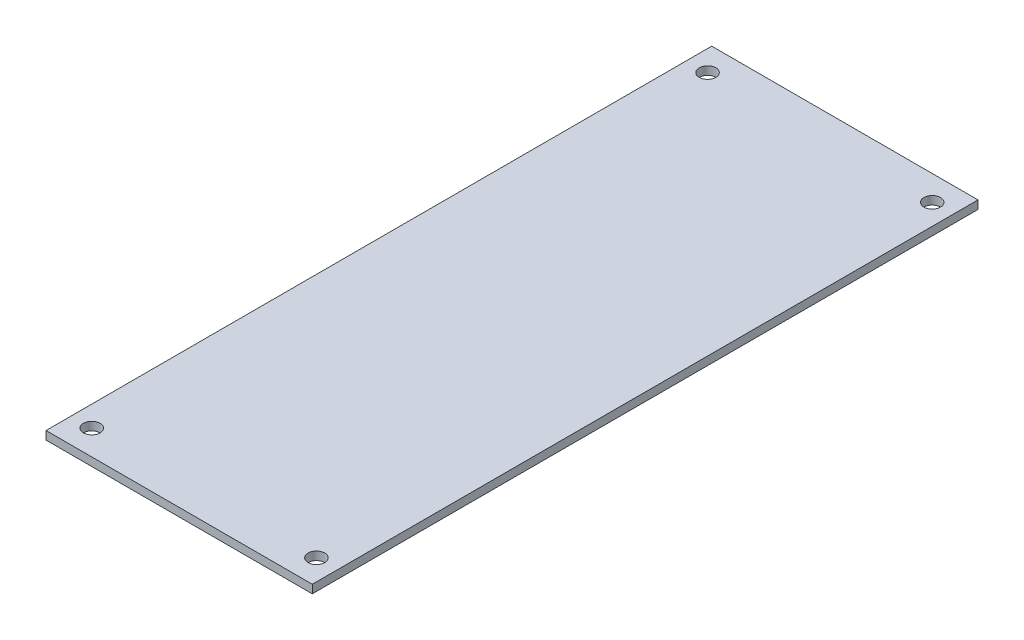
ISO-10303-21;
HEADER;
FILE_DESCRIPTION(('STEP AP214'),'2;1');
FILE_NAME('part.step','',(''),(''),'','','');
FILE_SCHEMA(('AUTOMOTIVE_DESIGN { 1 0 10303 214 1 1 1 1 }'));
ENDSEC;
DATA;
#1=APPLICATION_CONTEXT('core data for automotive mechanical design processes');
#2=APPLICATION_PROTOCOL_DEFINITION('international standard','automotive_design',2000,#1);
#3=PRODUCT_CONTEXT('',#1,'mechanical');
#4=PRODUCT('Part','Part','',(#3));
#5=PRODUCT_RELATED_PRODUCT_CATEGORY('part','',(#4));
#6=PRODUCT_DEFINITION_FORMATION('','',#4);
#7=PRODUCT_DEFINITION_CONTEXT('part definition',#1,'design');
#8=PRODUCT_DEFINITION('design','',#6,#7);
#9=PRODUCT_DEFINITION_SHAPE('','',#8);
#10=(LENGTH_UNIT() NAMED_UNIT(*) SI_UNIT(.MILLI.,.METRE.));
#11=(NAMED_UNIT(*) PLANE_ANGLE_UNIT() SI_UNIT($,.RADIAN.));
#12=(NAMED_UNIT(*) SI_UNIT($,.STERADIAN.) SOLID_ANGLE_UNIT());
#13=UNCERTAINTY_MEASURE_WITH_UNIT(LENGTH_MEASURE(1.E-05),#10,'distance_accuracy_value','');
#14=(GEOMETRIC_REPRESENTATION_CONTEXT(3) GLOBAL_UNCERTAINTY_ASSIGNED_CONTEXT((#13)) GLOBAL_UNIT_ASSIGNED_CONTEXT((#10,
#11,#12)) REPRESENTATION_CONTEXT('',''));
#15=CARTESIAN_POINT('',(0.,0.,0.));
#16=DIRECTION('',(0.,0.,1.));
#17=DIRECTION('',(1.,0.,0.));
#18=AXIS2_PLACEMENT_3D('',#15,#16,#17);
#19=CARTESIAN_POINT('',(0.,0.,0.));
#20=DIRECTION('',(0.,1.,0.));
#21=DIRECTION('',(0.,0.,1.));
#22=AXIS2_PLACEMENT_3D('',#19,#20,#21);
#23=PLANE('',#22);
#24=DIRECTION('',(1.,0.,0.));
#25=VECTOR('',#24,1.);
#26=CARTESIAN_POINT('',(2.15876699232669E-13,0.,55.5625000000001));
#27=LINE('',#26,#25);
#28=CARTESIAN_POINT('',(18.25625,0.,55.5625));
#29=VERTEX_POINT('',#28);
#30=CARTESIAN_POINT('',(25.4,0.,55.5625));
#31=VERTEX_POINT('',#30);
#32=EDGE_CURVE('E13',#29,#31,#27,.T.);
#33=ORIENTED_EDGE('',*,*,#32,.F.);
#34=DIRECTION('',(0.,0.,-1.));
#35=VECTOR('',#34,1.);
#36=CARTESIAN_POINT('',(18.25625,0.,0.));
#37=LINE('',#36,#35);
#38=CARTESIAN_POINT('',(18.25625,0.,61.9125));
#39=VERTEX_POINT('',#38);
#40=EDGE_CURVE('E61',#39,#29,#37,.T.);
#41=ORIENTED_EDGE('',*,*,#40,.F.);
#42=DIRECTION('',(-1.,0.,0.));
#43=VECTOR('',#42,1.);
#44=CARTESIAN_POINT('',(2.40548322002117E-13,0.,61.9125000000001));
#45=LINE('',#44,#43);
#46=CARTESIAN_POINT('',(25.4,0.,61.9125));
#47=VERTEX_POINT('',#46);
#48=EDGE_CURVE('E198',#47,#39,#45,.T.);
#49=ORIENTED_EDGE('',*,*,#48,.F.);
#50=DIRECTION('',(0.,0.,-1.));
#51=VECTOR('',#50,1.);
#52=CARTESIAN_POINT('',(25.4,0.,-63.5));
#53=LINE('',#52,#51);
#54=CARTESIAN_POINT('',(25.4,0.,63.5));
#55=VERTEX_POINT('',#54);
#56=EDGE_CURVE('E210',#55,#47,#53,.T.);
#57=ORIENTED_EDGE('',*,*,#56,.F.);
#58=DIRECTION('',(1.,0.,0.));
#59=VECTOR('',#58,1.);
#60=CARTESIAN_POINT('',(-25.4,0.,63.5));
#61=LINE('',#60,#59);
#62=CARTESIAN_POINT('',(-25.4,0.,63.5));
#63=VERTEX_POINT('',#62);
#64=EDGE_CURVE('E157',#63,#55,#61,.T.);
#65=ORIENTED_EDGE('',*,*,#64,.F.);
#66=DIRECTION('',(0.,0.,1.));
#67=VECTOR('',#66,1.);
#68=CARTESIAN_POINT('',(-25.4,0.,-63.5));
#69=LINE('',#68,#67);
#70=CARTESIAN_POINT('',(-25.4,0.,61.9125));
#71=VERTEX_POINT('',#70);
#72=EDGE_CURVE('E216',#71,#63,#69,.T.);
#73=ORIENTED_EDGE('',*,*,#72,.F.);
#74=DIRECTION('',(-1.,0.,0.));
#75=VECTOR('',#74,1.);
#76=CARTESIAN_POINT('',(-2.40548322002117E-13,0.,61.9125000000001));
#77=LINE('',#76,#75);
#78=CARTESIAN_POINT('',(-18.25625,0.,61.9125));
#79=VERTEX_POINT('',#78);
#80=EDGE_CURVE('E180',#79,#71,#77,.T.);
#81=ORIENTED_EDGE('',*,*,#80,.F.);
#82=DIRECTION('',(0.,0.,1.));
#83=VECTOR('',#82,1.);
#84=CARTESIAN_POINT('',(-18.25625,0.,0.));
#85=LINE('',#84,#83);
#86=CARTESIAN_POINT('',(-18.25625,0.,55.5625));
#87=VERTEX_POINT('',#86);
#88=EDGE_CURVE('E183',#87,#79,#85,.T.);
#89=ORIENTED_EDGE('',*,*,#88,.F.);
#90=DIRECTION('',(1.,0.,0.));
#91=VECTOR('',#90,1.);
#92=CARTESIAN_POINT('',(-2.15876699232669E-13,0.,55.5625000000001));
#93=LINE('',#92,#91);
#94=CARTESIAN_POINT('',(-25.4,0.,55.5625));
#95=VERTEX_POINT('',#94);
#96=EDGE_CURVE('E186',#95,#87,#93,.T.);
#97=ORIENTED_EDGE('',*,*,#96,.F.);
#98=CARTESIAN_POINT('',(-25.4,0.,-55.5625));
#99=VERTEX_POINT('',#98);
#100=EDGE_CURVE('E241',#99,#95,#69,.T.);
#101=ORIENTED_EDGE('',*,*,#100,.F.);
#102=DIRECTION('',(-1.,0.,0.));
#103=VECTOR('',#102,1.);
#104=CARTESIAN_POINT('',(0.,0.,-55.5625));
#105=LINE('',#104,#103);
#106=CARTESIAN_POINT('',(-18.25625,0.,-55.5625));
#107=VERTEX_POINT('',#106);
#108=EDGE_CURVE('E189',#107,#99,#105,.T.);
#109=ORIENTED_EDGE('',*,*,#108,.F.);
#110=DIRECTION('',(0.,0.,1.));
#111=VECTOR('',#110,1.);
#112=CARTESIAN_POINT('',(-18.25625,0.,0.));
#113=LINE('',#112,#111);
#114=CARTESIAN_POINT('',(-18.25625,0.,-61.9125));
#115=VERTEX_POINT('',#114);
#116=EDGE_CURVE('E192',#115,#107,#113,.T.);
#117=ORIENTED_EDGE('',*,*,#116,.F.);
#118=DIRECTION('',(1.,0.,0.));
#119=VECTOR('',#118,1.);
#120=CARTESIAN_POINT('',(0.,0.,-61.9125));
#121=LINE('',#120,#119);
#122=CARTESIAN_POINT('',(-25.4,0.,-61.9125));
#123=VERTEX_POINT('',#122);
#124=EDGE_CURVE('E195',#123,#115,#121,.T.);
#125=ORIENTED_EDGE('',*,*,#124,.F.);
#126=CARTESIAN_POINT('',(-25.4,0.,-63.5));
#127=VERTEX_POINT('',#126);
#128=EDGE_CURVE('E238',#127,#123,#69,.T.);
#129=ORIENTED_EDGE('',*,*,#128,.F.);
#130=DIRECTION('',(-1.,0.,0.));
#131=VECTOR('',#130,1.);
#132=CARTESIAN_POINT('',(-25.4,0.,-63.5));
#133=LINE('',#132,#131);
#134=CARTESIAN_POINT('',(25.4,0.,-63.5));
#135=VERTEX_POINT('',#134);
#136=EDGE_CURVE('E212',#135,#127,#133,.T.);
#137=ORIENTED_EDGE('',*,*,#136,.F.);
#138=CARTESIAN_POINT('',(25.4,0.,-61.9125));
#139=VERTEX_POINT('',#138);
#140=EDGE_CURVE('E162',#139,#135,#53,.T.);
#141=ORIENTED_EDGE('',*,*,#140,.F.);
#142=DIRECTION('',(1.,0.,0.));
#143=VECTOR('',#142,1.);
#144=CARTESIAN_POINT('',(0.,0.,-61.9125));
#145=LINE('',#144,#143);
#146=CARTESIAN_POINT('',(18.25625,0.,-61.9125));
#147=VERTEX_POINT('',#146);
#148=EDGE_CURVE('E177',#147,#139,#145,.T.);
#149=ORIENTED_EDGE('',*,*,#148,.F.);
#150=DIRECTION('',(0.,0.,-1.));
#151=VECTOR('',#150,1.);
#152=CARTESIAN_POINT('',(18.25625,0.,0.));
#153=LINE('',#152,#151);
#154=CARTESIAN_POINT('',(18.25625,0.,-55.5625));
#155=VERTEX_POINT('',#154);
#156=EDGE_CURVE('E168',#155,#147,#153,.T.);
#157=ORIENTED_EDGE('',*,*,#156,.F.);
#158=DIRECTION('',(-1.,0.,0.));
#159=VECTOR('',#158,1.);
#160=CARTESIAN_POINT('',(0.,0.,-55.5625));
#161=LINE('',#160,#159);
#162=CARTESIAN_POINT('',(25.4,0.,-55.5625));
#163=VERTEX_POINT('',#162);
#164=EDGE_CURVE('E164',#163,#155,#161,.T.);
#165=ORIENTED_EDGE('',*,*,#164,.F.);
#166=EDGE_CURVE('E214',#31,#163,#53,.T.);
#167=ORIENTED_EDGE('',*,*,#166,.F.);
#168=EDGE_LOOP('',(#33,#41,#49,#57,#65,#73,#81,#89,#97,#101,#109,#117,#125,#129,#137,#141,#149,
#157,#165,#167));
#169=FACE_BOUND('',#168,.T.);
#170=ADVANCED_FACE('F52',(#169),#23,.F.);
#171=CARTESIAN_POINT('',(21.43125,0.,58.7375));
#172=DIRECTION('',(0.,1.,0.));
#173=DIRECTION('',(0.,0.,1.));
#174=AXIS2_PLACEMENT_3D('',#171,#172,#173);
#175=CIRCLE('',#174,1.5875);
#176=CARTESIAN_POINT('',(21.43125,0.,60.325));
#177=VERTEX_POINT('',#176);
#178=EDGE_CURVE('E303',#177,#177,#175,.T.);
#179=ORIENTED_EDGE('',*,*,#178,.T.);
#180=EDGE_LOOP('',(#179));
#181=FACE_BOUND('',#180,.T.);
#182=ORIENTED_EDGE('',*,*,#40,.T.);
#183=ORIENTED_EDGE('',*,*,#32,.T.);
#184=EDGE_CURVE('E207',#47,#31,#53,.T.);
#185=ORIENTED_EDGE('',*,*,#184,.F.);
#186=ORIENTED_EDGE('',*,*,#48,.T.);
#187=EDGE_LOOP('',(#182,#183,#185,#186));
#188=FACE_BOUND('',#187,.T.);
#189=ADVANCED_FACE('F204',(#181,#188),#23,.F.);
#190=CARTESIAN_POINT('',(-21.43125,0.,-58.7375));
#191=DIRECTION('',(0.,1.,0.));
#192=DIRECTION('',(0.,0.,1.));
#193=AXIS2_PLACEMENT_3D('',#190,#191,#192);
#194=CIRCLE('',#193,1.5875);
#195=CARTESIAN_POINT('',(-21.43125,0.,-57.15));
#196=VERTEX_POINT('',#195);
#197=EDGE_CURVE('E222',#196,#196,#194,.T.);
#198=ORIENTED_EDGE('',*,*,#197,.T.);
#199=EDGE_LOOP('',(#198));
#200=FACE_BOUND('',#199,.T.);
#201=EDGE_CURVE('E240',#123,#99,#69,.T.);
#202=ORIENTED_EDGE('',*,*,#201,.F.);
#203=ORIENTED_EDGE('',*,*,#124,.T.);
#204=ORIENTED_EDGE('',*,*,#116,.T.);
#205=ORIENTED_EDGE('',*,*,#108,.T.);
#206=EDGE_LOOP('',(#202,#203,#204,#205));
#207=FACE_BOUND('',#206,.T.);
#208=ADVANCED_FACE('F269',(#200,#207),#23,.F.);
#209=CARTESIAN_POINT('',(-21.43125,0.,58.7375));
#210=DIRECTION('',(0.,1.,0.));
#211=DIRECTION('',(0.,0.,1.));
#212=AXIS2_PLACEMENT_3D('',#209,#210,#211);
#213=CIRCLE('',#212,1.5875);
#214=CARTESIAN_POINT('',(-21.43125,0.,60.325));
#215=VERTEX_POINT('',#214);
#216=EDGE_CURVE('E290',#215,#215,#213,.T.);
#217=ORIENTED_EDGE('',*,*,#216,.T.);
#218=EDGE_LOOP('',(#217));
#219=FACE_BOUND('',#218,.T.);
#220=EDGE_CURVE('E242',#95,#71,#69,.T.);
#221=ORIENTED_EDGE('',*,*,#220,.F.);
#222=ORIENTED_EDGE('',*,*,#96,.T.);
#223=ORIENTED_EDGE('',*,*,#88,.T.);
#224=ORIENTED_EDGE('',*,*,#80,.T.);
#225=EDGE_LOOP('',(#221,#222,#223,#224));
#226=FACE_BOUND('',#225,.T.);
#227=ADVANCED_FACE('F274',(#219,#226),#23,.F.);
#228=CARTESIAN_POINT('',(0.,1.5875,0.));
#229=DIRECTION('',(0.,1.,0.));
#230=DIRECTION('',(0.,0.,1.));
#231=AXIS2_PLACEMENT_3D('',#228,#229,#230);
#232=PLANE('',#231);
#233=CARTESIAN_POINT('',(21.43125,1.5875,58.7375));
#234=DIRECTION('',(0.,1.,0.));
#235=DIRECTION('',(0.,0.,1.));
#236=AXIS2_PLACEMENT_3D('',#233,#234,#235);
#237=CIRCLE('',#236,1.5875);
#238=CARTESIAN_POINT('',(21.43125,1.5875,60.325));
#239=VERTEX_POINT('',#238);
#240=EDGE_CURVE('E306',#239,#239,#237,.T.);
#241=ORIENTED_EDGE('',*,*,#240,.F.);
#242=EDGE_LOOP('',(#241));
#243=FACE_BOUND('',#242,.T.);
#244=CARTESIAN_POINT('',(-21.43125,1.5875,-58.7375));
#245=DIRECTION('',(0.,1.,0.));
#246=DIRECTION('',(0.,0.,1.));
#247=AXIS2_PLACEMENT_3D('',#244,#245,#246);
#248=CIRCLE('',#247,1.5875);
#249=CARTESIAN_POINT('',(-21.43125,1.5875,-57.15));
#250=VERTEX_POINT('',#249);
#251=EDGE_CURVE('E220',#250,#250,#248,.T.);
#252=ORIENTED_EDGE('',*,*,#251,.F.);
#253=EDGE_LOOP('',(#252));
#254=FACE_BOUND('',#253,.T.);
#255=DIRECTION('',(0.,0.,-1.));
#256=VECTOR('',#255,1.);
#257=CARTESIAN_POINT('',(25.4,1.5875,-63.5));
#258=LINE('',#257,#256);
#259=CARTESIAN_POINT('',(25.4,1.5875,63.5));
#260=VERTEX_POINT('',#259);
#261=CARTESIAN_POINT('',(25.4,1.5875,-63.5));
#262=VERTEX_POINT('',#261);
#263=EDGE_CURVE('E147',#260,#262,#258,.T.);
#264=ORIENTED_EDGE('',*,*,#263,.T.);
#265=DIRECTION('',(-1.,0.,0.));
#266=VECTOR('',#265,1.);
#267=CARTESIAN_POINT('',(-25.4,1.5875,-63.5));
#268=LINE('',#267,#266);
#269=CARTESIAN_POINT('',(-25.4,1.5875,-63.5));
#270=VERTEX_POINT('',#269);
#271=EDGE_CURVE('E137',#262,#270,#268,.T.);
#272=ORIENTED_EDGE('',*,*,#271,.T.);
#273=DIRECTION('',(0.,0.,1.));
#274=VECTOR('',#273,1.);
#275=CARTESIAN_POINT('',(-25.4,1.5875,-63.5));
#276=LINE('',#275,#274);
#277=CARTESIAN_POINT('',(-25.4,1.5875,63.5));
#278=VERTEX_POINT('',#277);
#279=EDGE_CURVE('E146',#270,#278,#276,.T.);
#280=ORIENTED_EDGE('',*,*,#279,.T.);
#281=DIRECTION('',(1.,0.,0.));
#282=VECTOR('',#281,1.);
#283=CARTESIAN_POINT('',(-25.4,1.5875,63.5));
#284=LINE('',#283,#282);
#285=EDGE_CURVE('E153',#278,#260,#284,.T.);
#286=ORIENTED_EDGE('',*,*,#285,.T.);
#287=EDGE_LOOP('',(#264,#272,#280,#286));
#288=FACE_BOUND('',#287,.T.);
#289=CARTESIAN_POINT('',(21.43125,1.5875,-58.7375));
#290=DIRECTION('',(0.,1.,0.));
#291=DIRECTION('',(0.,0.,1.));
#292=AXIS2_PLACEMENT_3D('',#289,#290,#291);
#293=CIRCLE('',#292,1.5875);
#294=CARTESIAN_POINT('',(21.43125,1.5875,-57.15));
#295=VERTEX_POINT('',#294);
#296=EDGE_CURVE('E227',#295,#295,#293,.T.);
#297=ORIENTED_EDGE('',*,*,#296,.F.);
#298=EDGE_LOOP('',(#297));
#299=FACE_BOUND('',#298,.T.);
#300=CARTESIAN_POINT('',(-21.43125,1.5875,58.7375));
#301=DIRECTION('',(0.,1.,0.));
#302=DIRECTION('',(0.,0.,1.));
#303=AXIS2_PLACEMENT_3D('',#300,#301,#302);
#304=CIRCLE('',#303,1.5875);
#305=CARTESIAN_POINT('',(-21.43125,1.5875,60.325));
#306=VERTEX_POINT('',#305);
#307=EDGE_CURVE('E300',#306,#306,#304,.T.);
#308=ORIENTED_EDGE('',*,*,#307,.F.);
#309=EDGE_LOOP('',(#308));
#310=FACE_BOUND('',#309,.T.);
#311=ADVANCED_FACE('F150',(#243,#254,#288,#299,#310),#232,.T.);
#312=ORIENTED_EDGE('',*,*,#156,.T.);
#313=ORIENTED_EDGE('',*,*,#148,.T.);
#314=EDGE_CURVE('E215',#163,#139,#53,.T.);
#315=ORIENTED_EDGE('',*,*,#314,.F.);
#316=ORIENTED_EDGE('',*,*,#164,.T.);
#317=EDGE_LOOP('',(#312,#313,#315,#316));
#318=FACE_BOUND('',#317,.T.);
#319=CARTESIAN_POINT('',(21.43125,0.,-58.7375));
#320=DIRECTION('',(0.,1.,0.));
#321=DIRECTION('',(0.,0.,1.));
#322=AXIS2_PLACEMENT_3D('',#319,#320,#321);
#323=CIRCLE('',#322,1.5875);
#324=CARTESIAN_POINT('',(21.43125,0.,-57.15));
#325=VERTEX_POINT('',#324);
#326=EDGE_CURVE('E230',#325,#325,#323,.T.);
#327=ORIENTED_EDGE('',*,*,#326,.T.);
#328=EDGE_LOOP('',(#327));
#329=FACE_BOUND('',#328,.T.);
#330=ADVANCED_FACE('F265',(#318,#329),#23,.F.);
#331=CARTESIAN_POINT('',(25.4,1.5875,-63.5));
#332=DIRECTION('',(-1.,0.,0.));
#333=DIRECTION('',(0.,0.,1.));
#334=AXIS2_PLACEMENT_3D('',#331,#332,#333);
#335=PLANE('',#334);
#336=ORIENTED_EDGE('',*,*,#56,.T.);
#337=ORIENTED_EDGE('',*,*,#184,.T.);
#338=ORIENTED_EDGE('',*,*,#166,.T.);
#339=ORIENTED_EDGE('',*,*,#314,.T.);
#340=ORIENTED_EDGE('',*,*,#140,.T.);
#341=DIRECTION('',(0.,-1.,0.));
#342=VECTOR('',#341,1.);
#343=CARTESIAN_POINT('',(25.4,1.5875,-63.5));
#344=LINE('',#343,#342);
#345=EDGE_CURVE('E141',#262,#135,#344,.T.);
#346=ORIENTED_EDGE('',*,*,#345,.F.);
#347=ORIENTED_EDGE('',*,*,#263,.F.);
#348=DIRECTION('',(0.,-1.,0.));
#349=VECTOR('',#348,1.);
#350=CARTESIAN_POINT('',(25.4,1.5875,63.5));
#351=LINE('',#350,#349);
#352=EDGE_CURVE('E233',#260,#55,#351,.T.);
#353=ORIENTED_EDGE('',*,*,#352,.T.);
#354=EDGE_LOOP('',(#336,#337,#338,#339,#340,#346,#347,#353));
#355=FACE_BOUND('',#354,.T.);
#356=ADVANCED_FACE('F54',(#355),#335,.F.);
#357=CARTESIAN_POINT('',(-25.4,1.5875,-63.5));
#358=DIRECTION('',(0.,0.,1.));
#359=DIRECTION('',(1.,0.,0.));
#360=AXIS2_PLACEMENT_3D('',#357,#358,#359);
#361=PLANE('',#360);
#362=ORIENTED_EDGE('',*,*,#136,.T.);
#363=DIRECTION('',(0.,-1.,0.));
#364=VECTOR('',#363,1.);
#365=CARTESIAN_POINT('',(-25.4,1.5875,-63.5));
#366=LINE('',#365,#364);
#367=EDGE_CURVE('E143',#270,#127,#366,.T.);
#368=ORIENTED_EDGE('',*,*,#367,.F.);
#369=ORIENTED_EDGE('',*,*,#271,.F.);
#370=ORIENTED_EDGE('',*,*,#345,.T.);
#371=EDGE_LOOP('',(#362,#368,#369,#370));
#372=FACE_BOUND('',#371,.T.);
#373=ADVANCED_FACE('F139',(#372),#361,.F.);
#374=CARTESIAN_POINT('',(-25.4,1.5875,-63.5));
#375=DIRECTION('',(1.,0.,0.));
#376=DIRECTION('',(0.,0.,-1.));
#377=AXIS2_PLACEMENT_3D('',#374,#375,#376);
#378=PLANE('',#377);
#379=ORIENTED_EDGE('',*,*,#128,.T.);
#380=ORIENTED_EDGE('',*,*,#201,.T.);
#381=ORIENTED_EDGE('',*,*,#100,.T.);
#382=ORIENTED_EDGE('',*,*,#220,.T.);
#383=ORIENTED_EDGE('',*,*,#72,.T.);
#384=DIRECTION('',(0.,-1.,0.));
#385=VECTOR('',#384,1.);
#386=CARTESIAN_POINT('',(-25.4,1.5875,63.5));
#387=LINE('',#386,#385);
#388=EDGE_CURVE('E170',#278,#63,#387,.T.);
#389=ORIENTED_EDGE('',*,*,#388,.F.);
#390=ORIENTED_EDGE('',*,*,#279,.F.);
#391=ORIENTED_EDGE('',*,*,#367,.T.);
#392=EDGE_LOOP('',(#379,#380,#381,#382,#383,#389,#390,#391));
#393=FACE_BOUND('',#392,.T.);
#394=ADVANCED_FACE('F249',(#393),#378,.F.);
#395=CARTESIAN_POINT('',(-25.4,1.5875,63.5));
#396=DIRECTION('',(0.,0.,-1.));
#397=DIRECTION('',(-1.,0.,0.));
#398=AXIS2_PLACEMENT_3D('',#395,#396,#397);
#399=PLANE('',#398);
#400=ORIENTED_EDGE('',*,*,#64,.T.);
#401=ORIENTED_EDGE('',*,*,#352,.F.);
#402=ORIENTED_EDGE('',*,*,#285,.F.);
#403=ORIENTED_EDGE('',*,*,#388,.T.);
#404=EDGE_LOOP('',(#400,#401,#402,#403));
#405=FACE_BOUND('',#404,.T.);
#406=ADVANCED_FACE('F252',(#405),#399,.F.);
#407=CARTESIAN_POINT('',(-21.43125,1.5875,-58.7375));
#408=DIRECTION('',(0.,-1.,0.));
#409=DIRECTION('',(0.,0.,-1.));
#410=AXIS2_PLACEMENT_3D('',#407,#408,#409);
#411=CYLINDRICAL_SURFACE('',#410,1.5875);
#412=ORIENTED_EDGE('',*,*,#251,.T.);
#413=EDGE_LOOP('',(#412));
#414=FACE_BOUND('',#413,.T.);
#415=ORIENTED_EDGE('',*,*,#197,.F.);
#416=EDGE_LOOP('',(#415));
#417=FACE_BOUND('',#416,.T.);
#418=ADVANCED_FACE('F254',(#414,#417),#411,.F.);
#419=CARTESIAN_POINT('',(21.43125,1.5875,-58.7375));
#420=DIRECTION('',(0.,-1.,0.));
#421=DIRECTION('',(0.,0.,-1.));
#422=AXIS2_PLACEMENT_3D('',#419,#420,#421);
#423=CYLINDRICAL_SURFACE('',#422,1.5875);
#424=ORIENTED_EDGE('',*,*,#296,.T.);
#425=EDGE_LOOP('',(#424));
#426=FACE_BOUND('',#425,.T.);
#427=ORIENTED_EDGE('',*,*,#326,.F.);
#428=EDGE_LOOP('',(#427));
#429=FACE_BOUND('',#428,.T.);
#430=ADVANCED_FACE('F260',(#426,#429),#423,.F.);
#431=CARTESIAN_POINT('',(21.43125,1.5875,58.7375));
#432=DIRECTION('',(0.,-1.,0.));
#433=DIRECTION('',(0.,0.,-1.));
#434=AXIS2_PLACEMENT_3D('',#431,#432,#433);
#435=CYLINDRICAL_SURFACE('',#434,1.5875);
#436=ORIENTED_EDGE('',*,*,#240,.T.);
#437=EDGE_LOOP('',(#436));
#438=FACE_BOUND('',#437,.T.);
#439=ORIENTED_EDGE('',*,*,#178,.F.);
#440=EDGE_LOOP('',(#439));
#441=FACE_BOUND('',#440,.T.);
#442=ADVANCED_FACE('F317',(#438,#441),#435,.F.);
#443=CARTESIAN_POINT('',(-21.43125,1.5875,58.7375));
#444=DIRECTION('',(0.,-1.,0.));
#445=DIRECTION('',(0.,0.,-1.));
#446=AXIS2_PLACEMENT_3D('',#443,#444,#445);
#447=CYLINDRICAL_SURFACE('',#446,1.5875);
#448=ORIENTED_EDGE('',*,*,#307,.T.);
#449=EDGE_LOOP('',(#448));
#450=FACE_BOUND('',#449,.T.);
#451=ORIENTED_EDGE('',*,*,#216,.F.);
#452=EDGE_LOOP('',(#451));
#453=FACE_BOUND('',#452,.T.);
#454=ADVANCED_FACE('F322',(#450,#453),#447,.F.);
#455=CLOSED_SHELL('',(#170,#189,#208,#227,#311,#330,#356,#373,#394,#406,#418,#430,#442,#454));
#456=MANIFOLD_SOLID_BREP('B2',#455);
#457=ADVANCED_BREP_SHAPE_REPRESENTATION('',(#18,#456),#14);
#458=SHAPE_DEFINITION_REPRESENTATION(#9,#457);
ENDSEC;
END-ISO-10303-21;
